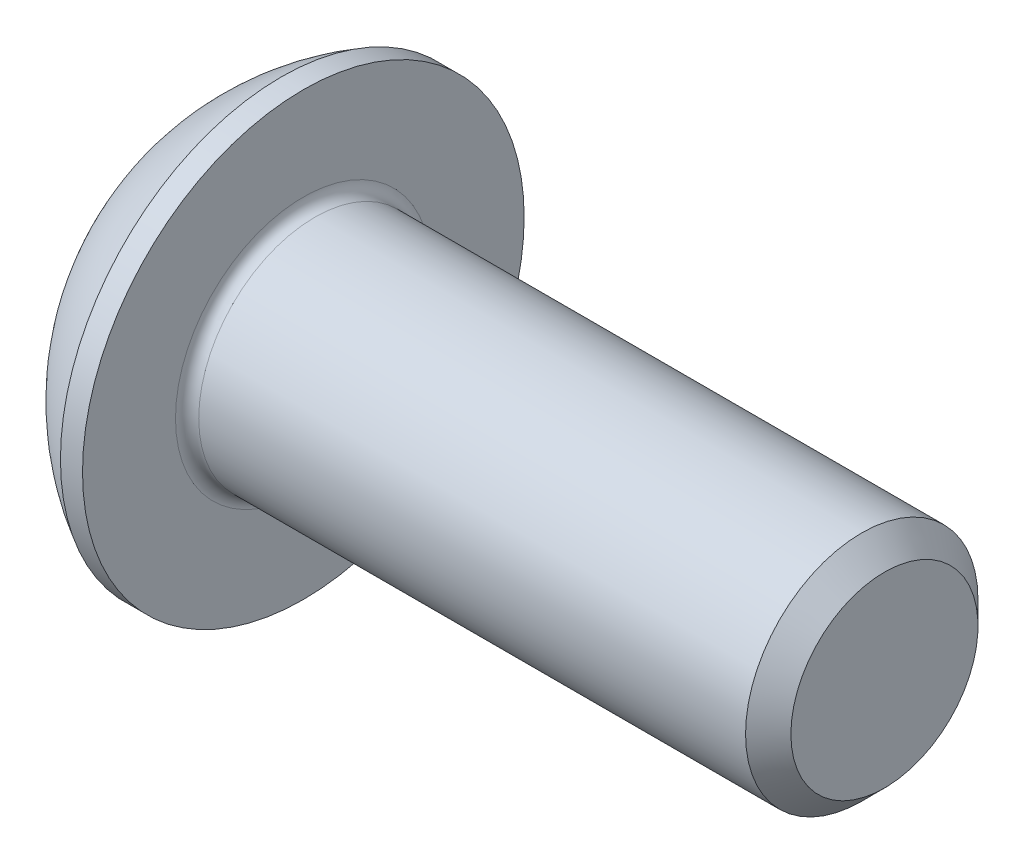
ISO-10303-21;
HEADER;
FILE_DESCRIPTION(('STEP AP214'),'2;1');
FILE_NAME('part.step','',(''),(''),'','','');
FILE_SCHEMA(('AUTOMOTIVE_DESIGN { 1 0 10303 214 1 1 1 1 }'));
ENDSEC;
DATA;
#1=APPLICATION_CONTEXT('core data for automotive mechanical design processes');
#2=APPLICATION_PROTOCOL_DEFINITION('international standard','automotive_design',2000,#1);
#3=PRODUCT_CONTEXT('',#1,'mechanical');
#4=PRODUCT('Part','Part','',(#3));
#5=PRODUCT_RELATED_PRODUCT_CATEGORY('part','',(#4));
#6=PRODUCT_DEFINITION_FORMATION('','',#4);
#7=PRODUCT_DEFINITION_CONTEXT('part definition',#1,'design');
#8=PRODUCT_DEFINITION('design','',#6,#7);
#9=PRODUCT_DEFINITION_SHAPE('','',#8);
#10=(LENGTH_UNIT() NAMED_UNIT(*) SI_UNIT(.MILLI.,.METRE.));
#11=(NAMED_UNIT(*) PLANE_ANGLE_UNIT() SI_UNIT($,.RADIAN.));
#12=(NAMED_UNIT(*) SI_UNIT($,.STERADIAN.) SOLID_ANGLE_UNIT());
#13=UNCERTAINTY_MEASURE_WITH_UNIT(LENGTH_MEASURE(1.E-05),#10,'distance_accuracy_value','');
#14=(GEOMETRIC_REPRESENTATION_CONTEXT(3) GLOBAL_UNCERTAINTY_ASSIGNED_CONTEXT((#13)) GLOBAL_UNIT_ASSIGNED_CONTEXT((#10,
#11,#12)) REPRESENTATION_CONTEXT('',''));
#15=CARTESIAN_POINT('',(0.,0.,0.));
#16=DIRECTION('',(0.,0.,1.));
#17=DIRECTION('',(1.,0.,0.));
#18=AXIS2_PLACEMENT_3D('',#15,#16,#17);
#19=CARTESIAN_POINT('',(0.,0.,0.));
#20=DIRECTION('',(-1.,0.,0.));
#21=DIRECTION('',(0.,0.,1.));
#22=AXIS2_PLACEMENT_3D('',#19,#20,#21);
#23=PLANE('',#22);
#24=CARTESIAN_POINT('',(0.,0.,0.));
#25=DIRECTION('',(-1.,0.,0.));
#26=DIRECTION('',(0.,0.,1.));
#27=AXIS2_PLACEMENT_3D('',#24,#25,#26);
#28=CIRCLE('',#27,1.9);
#29=CARTESIAN_POINT('',(0.,1.9,0.));
#30=VERTEX_POINT('',#29);
#31=EDGE_CURVE('E152',#30,#30,#28,.T.);
#32=ORIENTED_EDGE('',*,*,#31,.T.);
#33=EDGE_LOOP('',(#32));
#34=FACE_BOUND('',#33,.T.);
#35=DIRECTION('',(0.,-1.,0.));
#36=VECTOR('',#35,1.);
#37=CARTESIAN_POINT('',(0.,-0.721687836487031,1.25));
#38=LINE('',#37,#36);
#39=CARTESIAN_POINT('',(0.,0.721687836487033,1.25));
#40=VERTEX_POINT('',#39);
#41=CARTESIAN_POINT('',(0.,-0.721687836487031,1.25));
#42=VERTEX_POINT('',#41);
#43=EDGE_CURVE('E47',#40,#42,#38,.T.);
#44=ORIENTED_EDGE('',*,*,#43,.T.);
#45=DIRECTION('',(0.,-0.5,-0.866025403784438));
#46=VECTOR('',#45,1.);
#47=CARTESIAN_POINT('',(0.,-1.44337567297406,0.));
#48=LINE('',#47,#46);
#49=CARTESIAN_POINT('',(0.,-1.44337567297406,0.));
#50=VERTEX_POINT('',#49);
#51=EDGE_CURVE('E272',#42,#50,#48,.T.);
#52=ORIENTED_EDGE('',*,*,#51,.T.);
#53=DIRECTION('',(0.,0.5,-0.866025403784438));
#54=VECTOR('',#53,1.);
#55=CARTESIAN_POINT('',(0.,-0.721687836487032,-1.25));
#56=LINE('',#55,#54);
#57=CARTESIAN_POINT('',(0.,-0.721687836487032,-1.25));
#58=VERTEX_POINT('',#57);
#59=EDGE_CURVE('E127',#50,#58,#56,.T.);
#60=ORIENTED_EDGE('',*,*,#59,.T.);
#61=DIRECTION('',(0.,1.,0.));
#62=VECTOR('',#61,1.);
#63=CARTESIAN_POINT('',(0.,0.721687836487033,-1.25));
#64=LINE('',#63,#62);
#65=CARTESIAN_POINT('',(0.,0.721687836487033,-1.25));
#66=VERTEX_POINT('',#65);
#67=EDGE_CURVE('E275',#58,#66,#64,.T.);
#68=ORIENTED_EDGE('',*,*,#67,.T.);
#69=DIRECTION('',(0.,0.5,0.866025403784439));
#70=VECTOR('',#69,1.);
#71=CARTESIAN_POINT('',(0.,1.44337567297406,0.));
#72=LINE('',#71,#70);
#73=CARTESIAN_POINT('',(0.,1.44337567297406,0.));
#74=VERTEX_POINT('',#73);
#75=EDGE_CURVE('E277',#66,#74,#72,.T.);
#76=ORIENTED_EDGE('',*,*,#75,.T.);
#77=DIRECTION('',(0.,-0.5,0.866025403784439));
#78=VECTOR('',#77,1.);
#79=CARTESIAN_POINT('',(0.,0.721687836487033,1.25));
#80=LINE('',#79,#78);
#81=EDGE_CURVE('E279',#74,#40,#80,.T.);
#82=ORIENTED_EDGE('',*,*,#81,.T.);
#83=EDGE_LOOP('',(#44,#52,#60,#68,#76,#82));
#84=FACE_BOUND('',#83,.T.);
#85=ADVANCED_FACE('F32',(#34,#84),#23,.T.);
#86=CARTESIAN_POINT('',(3.88527472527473,0.,0.));
#87=DIRECTION('',(-1.,0.,0.));
#88=DIRECTION('',(0.,1.,0.));
#89=AXIS2_PLACEMENT_3D('',#86,#87,#88);
#90=SPHERICAL_SURFACE('',#89,4.3249693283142);
#91=CARTESIAN_POINT('',(1.82,0.,0.));
#92=DIRECTION('',(-1.,0.,0.));
#93=DIRECTION('',(0.,0.,1.));
#94=AXIS2_PLACEMENT_3D('',#91,#92,#93);
#95=CIRCLE('',#94,3.8);
#96=CARTESIAN_POINT('',(1.82,3.8,0.));
#97=VERTEX_POINT('',#96);
#98=EDGE_CURVE('E149',#97,#97,#95,.T.);
#99=CARTESIAN_POINT('',(1.82,3.8,0.));
#100=CARTESIAN_POINT('',(1.79553223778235,3.78670197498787,0.));
#101=CARTESIAN_POINT('',(1.77119294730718,3.77316757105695,0.));
#102=CARTESIAN_POINT('',(1.72278031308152,3.74563119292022,0.));
#103=CARTESIAN_POINT('',(1.69870696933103,3.7316292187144,0.));
#104=CARTESIAN_POINT('',(1.65083523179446,3.7031628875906,0.));
#105=CARTESIAN_POINT('',(1.62703683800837,3.6886985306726,0.));
#106=CARTESIAN_POINT('',(1.57972387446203,3.65931284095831,0.));
#107=CARTESIAN_POINT('',(1.55620930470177,3.64439150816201,0.));
#108=CARTESIAN_POINT('',(1.50947276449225,3.61409743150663,0.));
#109=CARTESIAN_POINT('',(1.48625079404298,3.59872468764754,0.));
#110=CARTESIAN_POINT('',(1.44010811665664,3.56753352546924,0.));
#111=CARTESIAN_POINT('',(1.41718740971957,3.55171510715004,0.));
#112=CARTESIAN_POINT('',(1.37165581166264,3.51963849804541,0.));
#113=CARTESIAN_POINT('',(1.34904492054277,3.50338030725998,0.));
#114=CARTESIAN_POINT('',(1.30414139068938,3.47043021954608,0.));
#115=CARTESIAN_POINT('',(1.28184875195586,3.45373832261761,0.));
#116=CARTESIAN_POINT('',(1.23759004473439,3.41992705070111,0.));
#117=CARTESIAN_POINT('',(1.21562397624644,3.40280767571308,0.));
#118=CARTESIAN_POINT('',(1.17202660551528,3.3681478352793,0.));
#119=CARTESIAN_POINT('',(1.15039530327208,3.35060736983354,0.));
#120=CARTESIAN_POINT('',(1.10747553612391,3.31511189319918,0.));
#121=CARTESIAN_POINT('',(1.08618707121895,3.29715688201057,0.));
#122=CARTESIAN_POINT('',(1.04396092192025,3.26083901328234,0.));
#123=CARTESIAN_POINT('',(1.02302323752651,3.24247615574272,0.));
#124=CARTESIAN_POINT('',(0.981506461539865,3.20534944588,0.));
#125=CARTESIAN_POINT('',(0.960927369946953,3.18658559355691,0.));
#126=CARTESIAN_POINT('',(0.920135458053,3.14866389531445,0.));
#127=CARTESIAN_POINT('',(0.899922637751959,3.12950604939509,0.));
#128=CARTESIAN_POINT('',(0.859870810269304,3.09080351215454,0.));
#129=CARTESIAN_POINT('',(0.84003180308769,3.07125882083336,0.));
#130=CARTESIAN_POINT('',(0.800735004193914,3.0317898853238,0.));
#131=CARTESIAN_POINT('',(0.781277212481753,3.01186564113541,0.));
#132=CARTESIAN_POINT('',(0.74275010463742,2.97164503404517,0.));
#133=CARTESIAN_POINT('',(0.723680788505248,2.95134867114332,0.));
#134=CARTESIAN_POINT('',(0.685937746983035,2.91039139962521,0.));
#135=CARTESIAN_POINT('',(0.667264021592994,2.88973049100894,0.));
#136=CARTESIAN_POINT('',(0.630319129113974,2.84805183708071,0.));
#137=CARTESIAN_POINT('',(0.612047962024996,2.82703409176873,0.));
#138=CARTESIAN_POINT('',(0.575915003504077,2.78464960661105,0.));
#139=CARTESIAN_POINT('',(0.558053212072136,2.76328286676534,0.));
#140=CARTESIAN_POINT('',(0.522745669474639,2.72020836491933,0.));
#141=CARTESIAN_POINT('',(0.505299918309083,2.69850060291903,0.));
#142=CARTESIAN_POINT('',(0.470830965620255,2.65475215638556,0.));
#143=CARTESIAN_POINT('',(0.453807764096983,2.63271147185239,0.));
#144=CARTESIAN_POINT('',(0.420190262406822,2.58830540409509,0.));
#145=CARTESIAN_POINT('',(0.403595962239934,2.56594002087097,0.));
#146=CARTESIAN_POINT('',(0.370842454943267,2.52089290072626,0.));
#147=CARTESIAN_POINT('',(0.354683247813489,2.49821116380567,0.));
#148=CARTESIAN_POINT('',(0.322805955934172,2.45253979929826,0.));
#149=CARTESIAN_POINT('',(0.307087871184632,2.42955017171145,0.));
#150=CARTESIAN_POINT('',(0.276098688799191,2.38327160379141,0.));
#151=CARTESIAN_POINT('',(0.26082759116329,2.35998266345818,0.));
#152=CARTESIAN_POINT('',(0.230738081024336,2.31311415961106,0.));
#153=CARTESIAN_POINT('',(0.215919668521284,2.28953459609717,0.));
#154=CARTESIAN_POINT('',(0.186741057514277,2.24209364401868,0.));
#155=CARTESIAN_POINT('',(0.172380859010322,2.21823225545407,0.));
#156=CARTESIAN_POINT('',(0.144124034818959,2.17023655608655,0.));
#157=CARTESIAN_POINT('',(0.13022740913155,2.14610224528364,0.));
#158=CARTESIAN_POINT('',(0.102902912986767,2.09756970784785,0.));
#159=CARTESIAN_POINT('',(0.0894750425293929,2.07317148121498,0.));
#160=CARTESIAN_POINT('',(0.0630930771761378,2.02412021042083,0.));
#161=CARTESIAN_POINT('',(0.0501389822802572,1.99946716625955,0.));
#162=CARTESIAN_POINT('',(0.0247093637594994,1.94991547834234,0.));
#163=CARTESIAN_POINT('',(0.0122338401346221,1.9250168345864,0.));
#164=CARTESIAN_POINT('',(0.,1.9,0.));
#165=B_SPLINE_CURVE_WITH_KNOTS('',3,(#99,#100,#101,#102,#103,#104,#105,#106,#107,#108,#109,#110,
#111,#112,#113,#114,#115,#116,#117,#118,#119,#120,#121,#122,#123,#124,#125,#126,#127,#128,#129,
#130,#131,#132,#133,#134,#135,#136,#137,#138,#139,#140,#141,#142,#143,#144,#145,#146,#147,#148,
#149,#150,#151,#152,#153,#154,#155,#156,#157,#158,#159,#160,#161,#162,#163,#164),.UNSPECIFIED.,
.F.,.F.,(4,2,2,2,2,2,2,2,2,2,2,2,2,2,2,2,2,2,2,2,2,2,2,2,2,2,2,2,2,2,2,2,4),(0.,
0.083542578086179,0.167085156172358,0.250627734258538,0.334170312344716,0.417712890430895,
0.501255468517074,0.584798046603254,0.668340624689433,0.751883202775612,0.835425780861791,
0.91896835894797,1.00251093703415,1.08605351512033,1.16959609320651,1.25313867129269,
1.33668124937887,1.42022382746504,1.50376640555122,1.5873089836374,1.67085156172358,
1.75439413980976,1.83793671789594,1.92147929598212,2.0050218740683,2.08856445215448,
2.17210703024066,2.25564960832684,2.33919218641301,2.42273476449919,2.50627734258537,
2.58981992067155,2.67336249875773),.UNSPECIFIED.);
#166=EDGE_CURVE('BSEAM173',#97,#30,#165,.T.);
#167=ORIENTED_EDGE('',*,*,#98,.T.);
#168=ORIENTED_EDGE('',*,*,#31,.F.);
#169=ORIENTED_EDGE('',*,*,#166,.T.);
#170=ORIENTED_EDGE('',*,*,#166,.F.);
#171=EDGE_LOOP('',(#167,#169,#168,#170));
#172=FACE_BOUND('',#171,.T.);
#173=ADVANCED_FACE('F173',(#172),#90,.T.);
#174=CARTESIAN_POINT('',(0.,0.,0.));
#175=DIRECTION('',(-1.,0.,0.));
#176=DIRECTION('',(0.,0.,1.));
#177=AXIS2_PLACEMENT_3D('',#174,#175,#176);
#178=CYLINDRICAL_SURFACE('',#177,3.8);
#179=ORIENTED_EDGE('',*,*,#98,.F.);
#180=EDGE_LOOP('',(#179));
#181=FACE_BOUND('',#180,.T.);
#182=CARTESIAN_POINT('',(2.2,0.,0.));
#183=DIRECTION('',(-1.,0.,0.));
#184=DIRECTION('',(0.,0.,1.));
#185=AXIS2_PLACEMENT_3D('',#182,#183,#184);
#186=CIRCLE('',#185,3.8);
#187=CARTESIAN_POINT('',(2.2,0.,3.8));
#188=VERTEX_POINT('',#187);
#189=EDGE_CURVE('E146',#188,#188,#186,.T.);
#190=ORIENTED_EDGE('',*,*,#189,.T.);
#191=EDGE_LOOP('',(#190));
#192=FACE_BOUND('',#191,.T.);
#193=ADVANCED_FACE('F178',(#181,#192),#178,.T.);
#194=CARTESIAN_POINT('',(2.2,2.,0.));
#195=DIRECTION('',(-1.,0.,0.));
#196=DIRECTION('',(0.,0.,1.));
#197=AXIS2_PLACEMENT_3D('',#194,#195,#196);
#198=PLANE('',#197);
#199=CARTESIAN_POINT('',(2.2,0.,0.));
#200=DIRECTION('',(-1.,0.,0.));
#201=DIRECTION('',(0.,0.,1.));
#202=AXIS2_PLACEMENT_3D('',#199,#200,#201);
#203=CIRCLE('',#202,2.2);
#204=CARTESIAN_POINT('',(2.2,0.,2.2));
#205=VERTEX_POINT('',#204);
#206=EDGE_CURVE('E40',#205,#205,#203,.T.);
#207=ORIENTED_EDGE('',*,*,#206,.T.);
#208=EDGE_LOOP('',(#207));
#209=FACE_BOUND('',#208,.T.);
#210=ORIENTED_EDGE('',*,*,#189,.F.);
#211=EDGE_LOOP('',(#210));
#212=FACE_BOUND('',#211,.T.);
#213=ADVANCED_FACE('F157',(#209,#212),#198,.F.);
#214=CARTESIAN_POINT('',(0.,0.,0.));
#215=DIRECTION('',(-1.,0.,0.));
#216=DIRECTION('',(0.,0.,1.));
#217=AXIS2_PLACEMENT_3D('',#214,#215,#216);
#218=CYLINDRICAL_SURFACE('',#217,2.);
#219=CARTESIAN_POINT('',(2.4,0.,0.));
#220=DIRECTION('',(-1.,0.,0.));
#221=DIRECTION('',(0.,0.,1.));
#222=AXIS2_PLACEMENT_3D('',#219,#220,#221);
#223=CIRCLE('',#222,2.);
#224=CARTESIAN_POINT('',(2.4,0.,2.));
#225=VERTEX_POINT('',#224);
#226=EDGE_CURVE('E11',#225,#225,#223,.F.);
#227=ORIENTED_EDGE('',*,*,#226,.T.);
#228=EDGE_LOOP('',(#227));
#229=FACE_BOUND('',#228,.T.);
#230=CARTESIAN_POINT('',(11.81,0.,0.));
#231=DIRECTION('',(-1.,0.,0.));
#232=DIRECTION('',(0.,0.,1.));
#233=AXIS2_PLACEMENT_3D('',#230,#231,#232);
#234=CIRCLE('',#233,2.);
#235=CARTESIAN_POINT('',(11.81,0.,2.));
#236=VERTEX_POINT('',#235);
#237=EDGE_CURVE('E143',#236,#236,#234,.T.);
#238=ORIENTED_EDGE('',*,*,#237,.T.);
#239=EDGE_LOOP('',(#238));
#240=FACE_BOUND('',#239,.T.);
#241=ADVANCED_FACE('F187',(#229,#240),#218,.T.);
#242=CARTESIAN_POINT('',(12.2,0.,0.));
#243=DIRECTION('',(-1.,0.,0.));
#244=DIRECTION('',(0.,0.,1.));
#245=AXIS2_PLACEMENT_3D('',#242,#243,#244);
#246=CONICAL_SURFACE('',#245,1.61,0.785398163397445);
#247=ORIENTED_EDGE('',*,*,#237,.F.);
#248=EDGE_LOOP('',(#247));
#249=FACE_BOUND('',#248,.T.);
#250=CARTESIAN_POINT('',(12.2,0.,0.));
#251=DIRECTION('',(-1.,0.,0.));
#252=DIRECTION('',(0.,0.,1.));
#253=AXIS2_PLACEMENT_3D('',#250,#251,#252);
#254=CIRCLE('',#253,1.61);
#255=CARTESIAN_POINT('',(12.2,0.,1.61));
#256=VERTEX_POINT('',#255);
#257=EDGE_CURVE('E139',#256,#256,#254,.T.);
#258=ORIENTED_EDGE('',*,*,#257,.T.);
#259=EDGE_LOOP('',(#258));
#260=FACE_BOUND('',#259,.T.);
#261=ADVANCED_FACE('F168',(#249,#260),#246,.T.);
#262=CARTESIAN_POINT('',(12.2,0.,0.));
#263=DIRECTION('',(-1.,0.,0.));
#264=DIRECTION('',(0.,0.,1.));
#265=AXIS2_PLACEMENT_3D('',#262,#263,#264);
#266=PLANE('',#265);
#267=ORIENTED_EDGE('',*,*,#257,.F.);
#268=EDGE_LOOP('',(#267));
#269=FACE_BOUND('',#268,.T.);
#270=ADVANCED_FACE('F161',(#269),#266,.F.);
#271=CARTESIAN_POINT('',(2.4,0.,0.));
#272=DIRECTION('',(-1.,0.,0.));
#273=DIRECTION('',(0.,0.,1.));
#274=AXIS2_PLACEMENT_3D('',#271,#272,#273);
#275=TOROIDAL_SURFACE('',#274,2.2,0.2);
#276=ORIENTED_EDGE('',*,*,#226,.F.);
#277=EDGE_LOOP('',(#276));
#278=FACE_BOUND('',#277,.T.);
#279=ORIENTED_EDGE('',*,*,#206,.F.);
#280=EDGE_LOOP('',(#279));
#281=FACE_BOUND('',#280,.T.);
#282=ADVANCED_FACE('F34',(#278,#281),#275,.F.);
#283=CARTESIAN_POINT('',(1.3,-1.44337567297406,0.));
#284=DIRECTION('',(0.,0.866025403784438,-0.5));
#285=DIRECTION('',(0.,0.5,0.866025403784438));
#286=AXIS2_PLACEMENT_3D('',#283,#284,#285);
#287=PLANE('',#286);
#288=DIRECTION('',(0.,-0.5,-0.866025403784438));
#289=VECTOR('',#288,1.);
#290=CARTESIAN_POINT('',(1.3,-1.44337567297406,0.));
#291=LINE('',#290,#289);
#292=CARTESIAN_POINT('',(1.3,-0.721687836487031,1.25));
#293=VERTEX_POINT('',#292);
#294=CARTESIAN_POINT('',(1.3,-1.08253175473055,0.625));
#295=VERTEX_POINT('',#294);
#296=EDGE_CURVE('E113',#293,#295,#291,.T.);
#297=ORIENTED_EDGE('',*,*,#296,.T.);
#298=CARTESIAN_POINT('',(1.3,-1.44337567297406,0.));
#299=VERTEX_POINT('',#298);
#300=EDGE_CURVE('E108',#295,#299,#291,.T.);
#301=ORIENTED_EDGE('',*,*,#300,.T.);
#302=DIRECTION('',(-1.,0.,0.));
#303=VECTOR('',#302,1.);
#304=CARTESIAN_POINT('',(1.3,-1.44337567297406,0.));
#305=LINE('',#304,#303);
#306=EDGE_CURVE('E110',#299,#50,#305,.T.);
#307=ORIENTED_EDGE('',*,*,#306,.T.);
#308=ORIENTED_EDGE('',*,*,#51,.F.);
#309=DIRECTION('',(-1.,0.,0.));
#310=VECTOR('',#309,1.);
#311=CARTESIAN_POINT('',(1.3,-0.721687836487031,1.25));
#312=LINE('',#311,#310);
#313=EDGE_CURVE('E268',#293,#42,#312,.T.);
#314=ORIENTED_EDGE('',*,*,#313,.F.);
#315=EDGE_LOOP('',(#297,#301,#307,#308,#314));
#316=FACE_BOUND('',#315,.T.);
#317=ADVANCED_FACE('F109',(#316),#287,.T.);
#318=CARTESIAN_POINT('',(1.3,-0.721687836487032,-1.25));
#319=DIRECTION('',(0.,0.866025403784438,0.5));
#320=DIRECTION('',(0.,-0.5,0.866025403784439));
#321=AXIS2_PLACEMENT_3D('',#318,#319,#320);
#322=PLANE('',#321);
#323=DIRECTION('',(0.,0.5,-0.866025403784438));
#324=VECTOR('',#323,1.);
#325=CARTESIAN_POINT('',(1.3,-0.721687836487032,-1.25));
#326=LINE('',#325,#324);
#327=CARTESIAN_POINT('',(1.3,-1.08253175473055,-0.625000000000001));
#328=VERTEX_POINT('',#327);
#329=EDGE_CURVE('E55',#299,#328,#326,.T.);
#330=ORIENTED_EDGE('',*,*,#329,.T.);
#331=CARTESIAN_POINT('',(1.3,-0.721687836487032,-1.25));
#332=VERTEX_POINT('',#331);
#333=EDGE_CURVE('E122',#328,#332,#326,.T.);
#334=ORIENTED_EDGE('',*,*,#333,.T.);
#335=DIRECTION('',(-1.,0.,0.));
#336=VECTOR('',#335,1.);
#337=CARTESIAN_POINT('',(1.3,-0.721687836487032,-1.25));
#338=LINE('',#337,#336);
#339=EDGE_CURVE('E129',#332,#58,#338,.T.);
#340=ORIENTED_EDGE('',*,*,#339,.T.);
#341=ORIENTED_EDGE('',*,*,#59,.F.);
#342=ORIENTED_EDGE('',*,*,#306,.F.);
#343=EDGE_LOOP('',(#330,#334,#340,#341,#342));
#344=FACE_BOUND('',#343,.T.);
#345=ADVANCED_FACE('F125',(#344),#322,.T.);
#346=CARTESIAN_POINT('',(1.3,0.721687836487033,-1.25));
#347=DIRECTION('',(0.,0.,1.));
#348=DIRECTION('',(1.,0.,0.));
#349=AXIS2_PLACEMENT_3D('',#346,#347,#348);
#350=PLANE('',#349);
#351=DIRECTION('',(0.,1.,0.));
#352=VECTOR('',#351,1.);
#353=CARTESIAN_POINT('',(1.3,0.721687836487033,-1.25));
#354=LINE('',#353,#352);
#355=CARTESIAN_POINT('',(1.3,0.,-1.25));
#356=VERTEX_POINT('',#355);
#357=EDGE_CURVE('E249',#332,#356,#354,.T.);
#358=ORIENTED_EDGE('',*,*,#357,.T.);
#359=CARTESIAN_POINT('',(1.3,0.721687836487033,-1.25));
#360=VERTEX_POINT('',#359);
#361=EDGE_CURVE('E121',#356,#360,#354,.T.);
#362=ORIENTED_EDGE('',*,*,#361,.T.);
#363=DIRECTION('',(-1.,0.,0.));
#364=VECTOR('',#363,1.);
#365=CARTESIAN_POINT('',(1.3,0.721687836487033,-1.25));
#366=LINE('',#365,#364);
#367=EDGE_CURVE('E134',#360,#66,#366,.T.);
#368=ORIENTED_EDGE('',*,*,#367,.T.);
#369=ORIENTED_EDGE('',*,*,#67,.F.);
#370=ORIENTED_EDGE('',*,*,#339,.F.);
#371=EDGE_LOOP('',(#358,#362,#368,#369,#370));
#372=FACE_BOUND('',#371,.T.);
#373=ADVANCED_FACE('F201',(#372),#350,.T.);
#374=CARTESIAN_POINT('',(1.3,1.44337567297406,0.));
#375=DIRECTION('',(0.,-0.866025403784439,0.5));
#376=DIRECTION('',(0.,-0.5,-0.866025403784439));
#377=AXIS2_PLACEMENT_3D('',#374,#375,#376);
#378=PLANE('',#377);
#379=DIRECTION('',(0.,0.5,0.866025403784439));
#380=VECTOR('',#379,1.);
#381=CARTESIAN_POINT('',(1.3,1.44337567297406,0.));
#382=LINE('',#381,#380);
#383=CARTESIAN_POINT('',(1.3,1.08253175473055,-0.625));
#384=VERTEX_POINT('',#383);
#385=EDGE_CURVE('E238',#360,#384,#382,.T.);
#386=ORIENTED_EDGE('',*,*,#385,.T.);
#387=CARTESIAN_POINT('',(1.3,1.44337567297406,0.));
#388=VERTEX_POINT('',#387);
#389=EDGE_CURVE('E243',#384,#388,#382,.T.);
#390=ORIENTED_EDGE('',*,*,#389,.T.);
#391=DIRECTION('',(-1.,0.,0.));
#392=VECTOR('',#391,1.);
#393=CARTESIAN_POINT('',(1.3,1.44337567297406,0.));
#394=LINE('',#393,#392);
#395=EDGE_CURVE('E283',#388,#74,#394,.T.);
#396=ORIENTED_EDGE('',*,*,#395,.T.);
#397=ORIENTED_EDGE('',*,*,#75,.F.);
#398=ORIENTED_EDGE('',*,*,#367,.F.);
#399=EDGE_LOOP('',(#386,#390,#396,#397,#398));
#400=FACE_BOUND('',#399,.T.);
#401=ADVANCED_FACE('F204',(#400),#378,.T.);
#402=CARTESIAN_POINT('',(1.3,0.721687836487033,1.25));
#403=DIRECTION('',(0.,-0.866025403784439,-0.5));
#404=DIRECTION('',(0.,0.5,-0.866025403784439));
#405=AXIS2_PLACEMENT_3D('',#402,#403,#404);
#406=PLANE('',#405);
#407=DIRECTION('',(0.,-0.5,0.866025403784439));
#408=VECTOR('',#407,1.);
#409=CARTESIAN_POINT('',(1.3,0.721687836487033,1.25));
#410=LINE('',#409,#408);
#411=CARTESIAN_POINT('',(1.3,1.08253175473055,0.625));
#412=VERTEX_POINT('',#411);
#413=EDGE_CURVE('E246',#388,#412,#410,.T.);
#414=ORIENTED_EDGE('',*,*,#413,.T.);
#415=CARTESIAN_POINT('',(1.3,0.721687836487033,1.25));
#416=VERTEX_POINT('',#415);
#417=EDGE_CURVE('E254',#412,#416,#410,.T.);
#418=ORIENTED_EDGE('',*,*,#417,.T.);
#419=DIRECTION('',(-1.,0.,0.));
#420=VECTOR('',#419,1.);
#421=CARTESIAN_POINT('',(1.3,0.721687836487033,1.25));
#422=LINE('',#421,#420);
#423=EDGE_CURVE('E267',#416,#40,#422,.T.);
#424=ORIENTED_EDGE('',*,*,#423,.T.);
#425=ORIENTED_EDGE('',*,*,#81,.F.);
#426=ORIENTED_EDGE('',*,*,#395,.F.);
#427=EDGE_LOOP('',(#414,#418,#424,#425,#426));
#428=FACE_BOUND('',#427,.T.);
#429=ADVANCED_FACE('F208',(#428),#406,.T.);
#430=CARTESIAN_POINT('',(1.3,-0.721687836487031,1.25));
#431=DIRECTION('',(0.,0.,-1.));
#432=DIRECTION('',(0.,1.,0.));
#433=AXIS2_PLACEMENT_3D('',#430,#431,#432);
#434=PLANE('',#433);
#435=DIRECTION('',(0.,-1.,0.));
#436=VECTOR('',#435,1.);
#437=CARTESIAN_POINT('',(1.3,-0.721687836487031,1.25));
#438=LINE('',#437,#436);
#439=CARTESIAN_POINT('',(1.3,0.,1.25));
#440=VERTEX_POINT('',#439);
#441=EDGE_CURVE('E260',#416,#440,#438,.T.);
#442=ORIENTED_EDGE('',*,*,#441,.T.);
#443=EDGE_CURVE('E262',#440,#293,#438,.T.);
#444=ORIENTED_EDGE('',*,*,#443,.T.);
#445=ORIENTED_EDGE('',*,*,#313,.T.);
#446=ORIENTED_EDGE('',*,*,#43,.F.);
#447=ORIENTED_EDGE('',*,*,#423,.F.);
#448=EDGE_LOOP('',(#442,#444,#445,#446,#447));
#449=FACE_BOUND('',#448,.T.);
#450=ADVANCED_FACE('F212',(#449),#434,.T.);
#451=CARTESIAN_POINT('',(1.3,-1.44337567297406,0.));
#452=DIRECTION('',(1.,0.,0.));
#453=DIRECTION('',(0.,0.,-1.));
#454=AXIS2_PLACEMENT_3D('',#451,#452,#453);
#455=PLANE('',#454);
#456=CARTESIAN_POINT('',(1.3,0.,0.));
#457=DIRECTION('',(-1.,0.,0.));
#458=DIRECTION('',(0.,0.,1.));
#459=AXIS2_PLACEMENT_3D('',#456,#457,#458);
#460=CIRCLE('',#459,1.25);
#461=EDGE_CURVE('E235',#384,#356,#460,.T.);
#462=ORIENTED_EDGE('',*,*,#461,.F.);
#463=ORIENTED_EDGE('',*,*,#385,.F.);
#464=ORIENTED_EDGE('',*,*,#361,.F.);
#465=EDGE_LOOP('',(#462,#463,#464));
#466=FACE_BOUND('',#465,.T.);
#467=ADVANCED_FACE('F216',(#466),#455,.F.);
#468=EDGE_CURVE('E140',#412,#384,#460,.T.);
#469=ORIENTED_EDGE('',*,*,#468,.F.);
#470=ORIENTED_EDGE('',*,*,#413,.F.);
#471=ORIENTED_EDGE('',*,*,#389,.F.);
#472=EDGE_LOOP('',(#469,#470,#471));
#473=FACE_BOUND('',#472,.T.);
#474=ADVANCED_FACE('F225',(#473),#455,.F.);
#475=EDGE_CURVE('E133',#440,#412,#460,.T.);
#476=ORIENTED_EDGE('',*,*,#475,.F.);
#477=ORIENTED_EDGE('',*,*,#441,.F.);
#478=ORIENTED_EDGE('',*,*,#417,.F.);
#479=EDGE_LOOP('',(#476,#477,#478));
#480=FACE_BOUND('',#479,.T.);
#481=ADVANCED_FACE('F230',(#480),#455,.F.);
#482=EDGE_CURVE('E128',#295,#440,#460,.T.);
#483=ORIENTED_EDGE('',*,*,#482,.F.);
#484=ORIENTED_EDGE('',*,*,#296,.F.);
#485=ORIENTED_EDGE('',*,*,#443,.F.);
#486=EDGE_LOOP('',(#483,#484,#485));
#487=FACE_BOUND('',#486,.T.);
#488=ADVANCED_FACE('F223',(#487),#455,.F.);
#489=EDGE_CURVE('E119',#328,#295,#460,.T.);
#490=ORIENTED_EDGE('',*,*,#489,.F.);
#491=ORIENTED_EDGE('',*,*,#329,.F.);
#492=ORIENTED_EDGE('',*,*,#300,.F.);
#493=EDGE_LOOP('',(#490,#491,#492));
#494=FACE_BOUND('',#493,.T.);
#495=ADVANCED_FACE('F118',(#494),#455,.F.);
#496=EDGE_CURVE('E241',#356,#328,#460,.T.);
#497=ORIENTED_EDGE('',*,*,#496,.F.);
#498=ORIENTED_EDGE('',*,*,#357,.F.);
#499=ORIENTED_EDGE('',*,*,#333,.F.);
#500=EDGE_LOOP('',(#497,#498,#499));
#501=FACE_BOUND('',#500,.T.);
#502=ADVANCED_FACE('F196',(#501),#455,.F.);
#503=CARTESIAN_POINT('',(2.02168783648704,0.,0.));
#504=DIRECTION('',(-1.,0.,0.));
#505=DIRECTION('',(0.,0.,1.));
#506=AXIS2_PLACEMENT_3D('',#503,#504,#505);
#507=CONICAL_SURFACE('',#506,0.,1.04719755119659);
#508=ORIENTED_EDGE('',*,*,#475,.T.);
#509=ORIENTED_EDGE('',*,*,#468,.T.);
#510=ORIENTED_EDGE('',*,*,#461,.T.);
#511=ORIENTED_EDGE('',*,*,#496,.T.);
#512=ORIENTED_EDGE('',*,*,#489,.T.);
#513=ORIENTED_EDGE('',*,*,#482,.T.);
#514=EDGE_LOOP('',(#508,#509,#510,#511,#512,#513));
#515=FACE_BOUND('',#514,.T.);
#516=CARTESIAN_POINT('',(2.02168783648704,0.,0.));
#517=VERTEX_POINT('',#516);
#518=VERTEX_LOOP('',#517);
#519=FACE_BOUND('',#518,.T.);
#520=ADVANCED_FACE('F194',(#515,#519),#507,.F.);
#521=CLOSED_SHELL('',(#85,#173,#193,#213,#241,#261,#270,#282,#317,#345,#373,#401,#429,#450,#467,
#474,#481,#488,#495,#502,#520));
#522=MANIFOLD_SOLID_BREP('B2',#521);
#523=ADVANCED_BREP_SHAPE_REPRESENTATION('',(#18,#522),#14);
#524=SHAPE_DEFINITION_REPRESENTATION(#9,#523);
ENDSEC;
END-ISO-10303-21;
